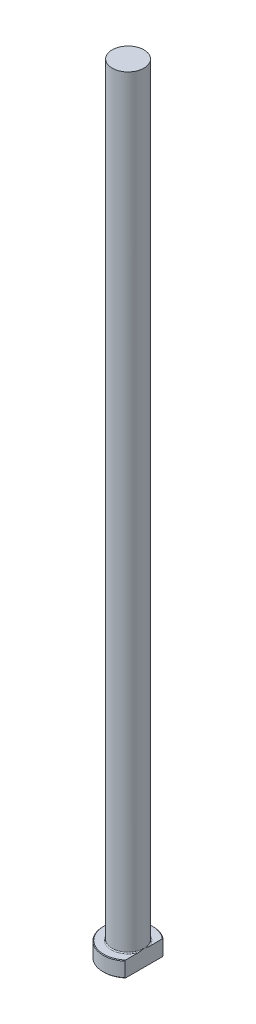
ISO-10303-21;
HEADER;
FILE_DESCRIPTION(('STEP AP214'),'2;1');
FILE_NAME('part.step','',(''),(''),'','','');
FILE_SCHEMA(('AUTOMOTIVE_DESIGN { 1 0 10303 214 1 1 1 1 }'));
ENDSEC;
DATA;
#1=APPLICATION_CONTEXT('core data for automotive mechanical design processes');
#2=APPLICATION_PROTOCOL_DEFINITION('international standard','automotive_design',2000,#1);
#3=PRODUCT_CONTEXT('',#1,'mechanical');
#4=PRODUCT('Part','Part','',(#3));
#5=PRODUCT_RELATED_PRODUCT_CATEGORY('part','',(#4));
#6=PRODUCT_DEFINITION_FORMATION('','',#4);
#7=PRODUCT_DEFINITION_CONTEXT('part definition',#1,'design');
#8=PRODUCT_DEFINITION('design','',#6,#7);
#9=PRODUCT_DEFINITION_SHAPE('','',#8);
#10=(LENGTH_UNIT() NAMED_UNIT(*) SI_UNIT(.MILLI.,.METRE.));
#11=(NAMED_UNIT(*) PLANE_ANGLE_UNIT() SI_UNIT($,.RADIAN.));
#12=(NAMED_UNIT(*) SI_UNIT($,.STERADIAN.) SOLID_ANGLE_UNIT());
#13=UNCERTAINTY_MEASURE_WITH_UNIT(LENGTH_MEASURE(1.E-05),#10,'distance_accuracy_value','');
#14=(GEOMETRIC_REPRESENTATION_CONTEXT(3) GLOBAL_UNCERTAINTY_ASSIGNED_CONTEXT((#13)) GLOBAL_UNIT_ASSIGNED_CONTEXT((#10,
#11,#12)) REPRESENTATION_CONTEXT('',''));
#15=CARTESIAN_POINT('',(0.,0.,0.));
#16=DIRECTION('',(0.,0.,1.));
#17=DIRECTION('',(1.,0.,0.));
#18=AXIS2_PLACEMENT_3D('',#15,#16,#17);
#19=CARTESIAN_POINT('',(0.,0.,0.));
#20=DIRECTION('',(0.,-1.,0.));
#21=DIRECTION('',(0.,0.,-1.));
#22=AXIS2_PLACEMENT_3D('',#19,#20,#21);
#23=PLANE('',#22);
#24=CARTESIAN_POINT('',(0.,0.,0.));
#25=DIRECTION('',(0.,-1.,0.));
#26=DIRECTION('',(0.,0.,-1.));
#27=AXIS2_PLACEMENT_3D('',#24,#25,#26);
#28=CIRCLE('',#27,7.79999999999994);
#29=CARTESIAN_POINT('',(5.09999999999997,0.,5.90169467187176));
#30=VERTEX_POINT('',#29);
#31=CARTESIAN_POINT('',(5.09999999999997,0.,-5.90169467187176));
#32=VERTEX_POINT('',#31);
#33=EDGE_CURVE('E98',#30,#32,#28,.T.);
#34=ORIENTED_EDGE('',*,*,#33,.T.);
#35=DIRECTION('',(0.,0.,1.));
#36=VECTOR('',#35,1.);
#37=CARTESIAN_POINT('',(5.09999999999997,0.,-6.16360284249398));
#38=LINE('',#37,#36);
#39=EDGE_CURVE('E83',#32,#30,#38,.T.);
#40=ORIENTED_EDGE('',*,*,#39,.T.);
#41=EDGE_LOOP('',(#34,#40));
#42=FACE_BOUND('',#41,.T.);
#43=ADVANCED_FACE('F32',(#42),#23,.T.);
#44=CARTESIAN_POINT('',(0.,259.958771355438,0.));
#45=DIRECTION('',(0.,1.,0.));
#46=DIRECTION('',(0.,0.,1.));
#47=AXIS2_PLACEMENT_3D('',#44,#45,#46);
#48=CYLINDRICAL_SURFACE('',#47,7.99999999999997);
#49=CARTESIAN_POINT('',(0.,4.80000000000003,0.));
#50=DIRECTION('',(0.,1.,0.));
#51=DIRECTION('',(0.,0.,1.));
#52=AXIS2_PLACEMENT_3D('',#49,#50,#51);
#53=CIRCLE('',#52,7.99999999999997);
#54=CARTESIAN_POINT('',(5.09999999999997,4.80000000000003,6.16360284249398));
#55=VERTEX_POINT('',#54);
#56=CARTESIAN_POINT('',(5.09999999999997,4.80000000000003,-6.16360284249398));
#57=VERTEX_POINT('',#56);
#58=EDGE_CURVE('E104',#55,#57,#53,.F.);
#59=ORIENTED_EDGE('',*,*,#58,.T.);
#60=DIRECTION('',(0.,-1.,0.));
#61=VECTOR('',#60,1.);
#62=CARTESIAN_POINT('',(5.09999999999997,250.,-6.16360284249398));
#63=LINE('',#62,#61);
#64=CARTESIAN_POINT('',(5.09999999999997,0.200000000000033,-6.16360284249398));
#65=VERTEX_POINT('',#64);
#66=EDGE_CURVE('E183',#57,#65,#63,.T.);
#67=ORIENTED_EDGE('',*,*,#66,.T.);
#68=CARTESIAN_POINT('',(0.,0.200000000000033,0.));
#69=DIRECTION('',(0.,-1.,0.));
#70=DIRECTION('',(0.,0.,-1.));
#71=AXIS2_PLACEMENT_3D('',#68,#69,#70);
#72=CIRCLE('',#71,7.99999999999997);
#73=CARTESIAN_POINT('',(5.09999999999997,0.200000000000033,6.16360284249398));
#74=VERTEX_POINT('',#73);
#75=EDGE_CURVE('E100',#65,#74,#72,.F.);
#76=ORIENTED_EDGE('',*,*,#75,.T.);
#77=DIRECTION('',(0.,-1.,0.));
#78=VECTOR('',#77,1.);
#79=CARTESIAN_POINT('',(5.09999999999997,250.,6.16360284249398));
#80=LINE('',#79,#78);
#81=EDGE_CURVE('E93',#55,#74,#80,.T.);
#82=ORIENTED_EDGE('',*,*,#81,.F.);
#83=EDGE_LOOP('',(#59,#67,#76,#82));
#84=FACE_BOUND('',#83,.T.);
#85=ADVANCED_FACE('F158',(#84),#48,.T.);
#86=CARTESIAN_POINT('',(-7.99999999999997,5.,0.));
#87=DIRECTION('',(0.,1.,0.));
#88=DIRECTION('',(0.,0.,1.));
#89=AXIS2_PLACEMENT_3D('',#86,#87,#88);
#90=PLANE('',#89);
#91=CARTESIAN_POINT('',(0.,5.,0.));
#92=DIRECTION('',(0.,1.,0.));
#93=DIRECTION('',(0.,0.,1.));
#94=AXIS2_PLACEMENT_3D('',#91,#92,#93);
#95=CIRCLE('',#94,7.79999999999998);
#96=CARTESIAN_POINT('',(5.09999999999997,5.,-5.9016946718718));
#97=VERTEX_POINT('',#96);
#98=CARTESIAN_POINT('',(5.09999999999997,5.,5.9016946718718));
#99=VERTEX_POINT('',#98);
#100=EDGE_CURVE('E178',#97,#99,#95,.T.);
#101=ORIENTED_EDGE('',*,*,#100,.T.);
#102=DIRECTION('',(0.,0.,-1.));
#103=VECTOR('',#102,1.);
#104=CARTESIAN_POINT('',(5.09999999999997,5.,0.));
#105=LINE('',#104,#103);
#106=CARTESIAN_POINT('',(5.09999999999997,4.99999999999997,1.77482393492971));
#107=VERTEX_POINT('',#106);
#108=EDGE_CURVE('E57',#99,#107,#105,.T.);
#109=ORIENTED_EDGE('',*,*,#108,.T.);
#110=CARTESIAN_POINT('',(0.,5.,0.));
#111=DIRECTION('',(0.,1.,0.));
#112=DIRECTION('',(0.,0.,1.));
#113=AXIS2_PLACEMENT_3D('',#110,#111,#112);
#114=CIRCLE('',#113,5.39999999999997);
#115=CARTESIAN_POINT('',(5.09999999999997,4.99999999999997,-1.77482393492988));
#116=VERTEX_POINT('',#115);
#117=EDGE_CURVE('E107',#107,#116,#114,.F.);
#118=ORIENTED_EDGE('',*,*,#117,.T.);
#119=EDGE_CURVE('E136',#116,#97,#105,.T.);
#120=ORIENTED_EDGE('',*,*,#119,.T.);
#121=EDGE_LOOP('',(#101,#109,#118,#120));
#122=FACE_BOUND('',#121,.T.);
#123=ADVANCED_FACE('F147',(#122),#90,.T.);
#124=CARTESIAN_POINT('',(0.,5.,0.));
#125=DIRECTION('',(0.,-1.,0.));
#126=DIRECTION('',(0.,0.,-1.));
#127=AXIS2_PLACEMENT_3D('',#124,#125,#126);
#128=CONICAL_SURFACE('',#127,7.79999999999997,0.785398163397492);
#129=ORIENTED_EDGE('',*,*,#58,.F.);
#130=CARTESIAN_POINT('',(5.09999999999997,-1.68838926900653,13.5610996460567));
#131=CARTESIAN_POINT('',(5.09999999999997,-1.49117445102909,13.3503958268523));
#132=CARTESIAN_POINT('',(5.09999999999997,-1.29425912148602,13.1394117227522));
#133=CARTESIAN_POINT('',(5.09999999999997,-0.901124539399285,12.7167935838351));
#134=CARTESIAN_POINT('',(5.09999999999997,-0.704905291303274,12.5051595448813));
#135=CARTESIAN_POINT('',(5.09999999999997,-0.117342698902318,11.8690459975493));
#136=CARTESIAN_POINT('',(5.09999999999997,0.272806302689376,11.4434608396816));
#137=CARTESIAN_POINT('',(5.09999999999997,1.05193640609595,10.5848872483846));
#138=CARTESIAN_POINT('',(5.09999999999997,1.44088225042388,10.1518667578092));
#139=CARTESIAN_POINT('',(5.09999999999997,2.21252525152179,9.28039822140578));
#140=CARTESIAN_POINT('',(5.09999999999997,2.59522339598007,8.84195105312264));
#141=CARTESIAN_POINT('',(5.09999999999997,3.2834654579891,8.03678680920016));
#142=CARTESIAN_POINT('',(5.09999999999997,3.59050446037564,7.67135442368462));
#143=CARTESIAN_POINT('',(5.09999999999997,4.04444149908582,7.1176457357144));
#144=CARTESIAN_POINT('',(5.09999999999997,4.19468098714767,6.93211011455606));
#145=CARTESIAN_POINT('',(5.09999999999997,4.49242146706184,6.55885365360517));
#146=CARTESIAN_POINT('',(5.09999999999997,4.63992249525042,6.37113284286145));
#147=CARTESIAN_POINT('',(5.09999999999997,4.93124846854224,5.99346825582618));
#148=CARTESIAN_POINT('',(5.09999999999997,5.07508033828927,5.80352983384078));
#149=CARTESIAN_POINT('',(5.09999999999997,5.35853965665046,5.42051054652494));
#150=CARTESIAN_POINT('',(5.09999999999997,5.49816682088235,5.22742946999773));
#151=CARTESIAN_POINT('',(5.09999999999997,5.77196390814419,4.83761664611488));
#152=CARTESIAN_POINT('',(5.09999999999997,5.90613746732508,4.6408874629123));
#153=CARTESIAN_POINT('',(5.09999999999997,6.1675386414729,4.24288639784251));
#154=CARTESIAN_POINT('',(5.09999999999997,6.29476755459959,4.0416153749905));
#155=CARTESIAN_POINT('',(5.09999999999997,6.51869473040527,3.66918005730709));
#156=CARTESIAN_POINT('',(5.09999999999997,6.61684568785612,3.49889306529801));
#157=CARTESIAN_POINT('',(5.09999999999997,6.80528626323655,3.15396122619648));
#158=CARTESIAN_POINT('',(5.09999999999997,6.89557493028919,2.97931585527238));
#159=CARTESIAN_POINT('',(5.09999999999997,7.06604933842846,2.62530631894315));
#160=CARTESIAN_POINT('',(5.09999999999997,7.14624387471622,2.44594642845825));
#161=CARTESIAN_POINT('',(5.09999999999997,7.29389284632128,2.08202755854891));
#162=CARTESIAN_POINT('',(5.09999999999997,7.36135077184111,1.89747001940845));
#163=CARTESIAN_POINT('',(5.09999999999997,7.46787946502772,1.56242413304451));
#164=CARTESIAN_POINT('',(5.09999999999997,7.50993657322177,1.41289089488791));
#165=CARTESIAN_POINT('',(5.09999999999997,7.58244227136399,1.11101527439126));
#166=CARTESIAN_POINT('',(5.09999999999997,7.61289239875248,0.958673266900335));
#167=CARTESIAN_POINT('',(5.09999999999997,7.66066060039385,0.652384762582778));
#168=CARTESIAN_POINT('',(5.09999999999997,7.67801796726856,0.498444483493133));
#169=CARTESIAN_POINT('',(5.09999999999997,7.69880109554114,0.189616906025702));
#170=CARTESIAN_POINT('',(5.09999999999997,7.70222744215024,0.0347296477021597));
#171=CARTESIAN_POINT('',(5.09999999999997,7.69494415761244,-0.274953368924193));
#172=CARTESIAN_POINT('',(5.09999999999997,7.68421202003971,-0.429748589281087));
#173=CARTESIAN_POINT('',(5.09999999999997,7.64918519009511,-0.737784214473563));
#174=CARTESIAN_POINT('',(5.09999999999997,7.62488939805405,-0.891024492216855));
#175=CARTESIAN_POINT('',(5.09999999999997,7.56389278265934,-1.19546940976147));
#176=CARTESIAN_POINT('',(5.09999999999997,7.52715417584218,-1.3466663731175));
#177=CARTESIAN_POINT('',(5.09999999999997,7.44288917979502,-1.64598767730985));
#178=CARTESIAN_POINT('',(5.09999999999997,7.39536249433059,-1.79411193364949));
#179=CARTESIAN_POINT('',(5.09999999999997,7.28286361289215,-2.110452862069));
#180=CARTESIAN_POINT('',(5.09999999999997,7.21631794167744,-2.27810587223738));
#181=CARTESIAN_POINT('',(5.09999999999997,7.07327742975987,-2.60914825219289));
#182=CARTESIAN_POINT('',(5.09999999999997,6.99677812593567,-2.77253566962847));
#183=CARTESIAN_POINT('',(5.09999999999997,6.83568399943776,-3.09559415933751));
#184=CARTESIAN_POINT('',(5.09999999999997,6.75107532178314,-3.25525827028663));
#185=CARTESIAN_POINT('',(5.09999999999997,6.57547395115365,-3.57098467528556));
#186=CARTESIAN_POINT('',(5.09999999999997,6.48448213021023,-3.7270474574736));
#187=CARTESIAN_POINT('',(5.09999999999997,6.29613682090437,-4.03803676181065));
#188=CARTESIAN_POINT('',(5.09999999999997,6.19871627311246,-4.19292248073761));
#189=CARTESIAN_POINT('',(5.09999999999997,5.99959202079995,-4.49991023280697));
#190=CARTESIAN_POINT('',(5.09999999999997,5.89788820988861,-4.6520121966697));
#191=CARTESIAN_POINT('',(5.09999999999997,5.69108681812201,-4.95365388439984));
#192=CARTESIAN_POINT('',(5.09999999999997,5.58599284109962,-5.10319608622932));
#193=CARTESIAN_POINT('',(5.09999999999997,5.37292107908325,-5.40020343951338));
#194=CARTESIAN_POINT('',(5.09999999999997,5.2649433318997,-5.54766861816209));
#195=CARTESIAN_POINT('',(5.09999999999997,5.02178839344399,-5.87409503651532));
#196=CARTESIAN_POINT('',(5.09999999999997,4.8860034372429,-6.05260304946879));
#197=CARTESIAN_POINT('',(5.09999999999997,4.61149829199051,-6.40735082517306));
#198=CARTESIAN_POINT('',(5.09999999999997,4.47277800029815,-6.58359050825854));
#199=CARTESIAN_POINT('',(5.09999999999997,4.05300130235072,-7.10948762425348));
#200=CARTESIAN_POINT('',(5.09999999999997,3.76835961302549,-7.45628264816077));
#201=CARTESIAN_POINT('',(5.09999999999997,3.19218529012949,-8.14465597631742));
#202=CARTESIAN_POINT('',(5.09999999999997,2.90064601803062,-8.48622868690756));
#203=CARTESIAN_POINT('',(5.09999999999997,2.31275375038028,-9.16521513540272));
#204=CARTESIAN_POINT('',(5.09999999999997,2.01640062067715,-9.50262875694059));
#205=CARTESIAN_POINT('',(5.09999999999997,1.43877149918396,-10.1532482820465));
#206=CARTESIAN_POINT('',(5.09999999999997,1.15771277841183,-10.4666475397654));
#207=CARTESIAN_POINT('',(5.09999999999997,0.593133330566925,-11.0912313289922));
#208=CARTESIAN_POINT('',(5.09999999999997,0.309612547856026,-11.4024158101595));
#209=CARTESIAN_POINT('',(5.09999999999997,-0.258772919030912,-12.0223487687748));
#210=CARTESIAN_POINT('',(5.09999999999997,-0.54363352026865,-12.3311009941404));
#211=CARTESIAN_POINT('',(5.09999999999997,-1.1149217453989,-12.9471274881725));
#212=CARTESIAN_POINT('',(5.09999999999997,-1.40134929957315,-13.2544018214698));
#213=CARTESIAN_POINT('',(5.09999999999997,-1.68838926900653,-13.5610996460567));
#214=B_SPLINE_CURVE_WITH_KNOTS('',3,(#130,#131,#132,#133,#134,#135,#136,#137,#138,#139,#140,
#141,#142,#143,#144,#145,#146,#147,#148,#149,#150,#151,#152,#153,#154,#155,#156,#157,#158,#159,
#160,#161,#162,#163,#164,#165,#166,#167,#168,#169,#170,#171,#172,#173,#174,#175,#176,#177,#178,
#179,#180,#181,#182,#183,#184,#185,#186,#187,#188,#189,#190,#191,#192,#193,#194,#195,#196,#197,
#198,#199,#200,#201,#202,#203,#204,#205,#206,#207,#208,#209,#210,#211,#212,#213),.UNSPECIFIED.,
.F.,.F.,(4,2,2,2,2,2,2,2,2,2,2,2,2,2,2,2,2,2,2,2,2,2,2,2,2,2,2,2,2,2,2,2,2,2,2,2,2,2,2,2,2,4),
(0.,0.865798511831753,1.73160254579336,3.4636456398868,5.20976443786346,6.95560446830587,
8.38738766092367,9.10357880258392,9.81976043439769,10.5344719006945,11.249231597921,
11.9635066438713,12.677647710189,13.2671324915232,13.8566884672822,14.4457271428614,
15.0346041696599,15.5002159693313,15.9657660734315,16.4299133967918,16.8940412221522,
17.3589077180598,17.8238119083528,18.2901406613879,18.7564822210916,19.2972067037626,
19.838174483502,20.3800835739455,20.921918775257,21.470762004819,22.01961887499,
22.5679103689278,23.116194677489,23.789002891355,24.4618346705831,25.807650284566,
27.1548185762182,28.5020244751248,29.7649097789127,31.0278236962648,32.2880803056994,
33.5482812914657),.UNSPECIFIED.);
#215=EDGE_CURVE('E135',#55,#99,#214,.T.);
#216=ORIENTED_EDGE('',*,*,#215,.T.);
#217=ORIENTED_EDGE('',*,*,#100,.F.);
#218=EDGE_CURVE('E127',#97,#57,#214,.T.);
#219=ORIENTED_EDGE('',*,*,#218,.T.);
#220=EDGE_LOOP('',(#129,#216,#217,#219));
#221=FACE_BOUND('',#220,.T.);
#222=ADVANCED_FACE('F143',(#221),#128,.T.);
#223=CARTESIAN_POINT('',(0.,0.200000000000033,0.));
#224=DIRECTION('',(0.,1.,0.));
#225=DIRECTION('',(0.,0.,1.));
#226=AXIS2_PLACEMENT_3D('',#223,#224,#225);
#227=CONICAL_SURFACE('',#226,7.99999999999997,0.785398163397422);
#228=ORIENTED_EDGE('',*,*,#75,.F.);
#229=CARTESIAN_POINT('',(5.09999999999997,6.68838926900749,-13.5610996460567));
#230=CARTESIAN_POINT('',(5.09999999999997,6.49117445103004,-13.3503958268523));
#231=CARTESIAN_POINT('',(5.09999999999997,6.29425912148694,-13.1394117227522));
#232=CARTESIAN_POINT('',(5.09999999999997,5.90112453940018,-12.7167935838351));
#233=CARTESIAN_POINT('',(5.09999999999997,5.70490529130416,-12.5051595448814));
#234=CARTESIAN_POINT('',(5.09999999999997,5.11734269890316,-11.8690459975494));
#235=CARTESIAN_POINT('',(5.09999999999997,4.72719369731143,-11.4434608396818));
#236=CARTESIAN_POINT('',(5.09999999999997,3.9480635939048,-10.5848872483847));
#237=CARTESIAN_POINT('',(5.09999999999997,3.55911774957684,-10.1518667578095));
#238=CARTESIAN_POINT('',(5.09999999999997,2.78747474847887,-9.28039822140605));
#239=CARTESIAN_POINT('',(5.09999999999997,2.40477660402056,-8.84195105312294));
#240=CARTESIAN_POINT('',(5.09999999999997,1.71653454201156,-8.03678680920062));
#241=CARTESIAN_POINT('',(5.09999999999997,1.40949553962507,-7.6713544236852));
#242=CARTESIAN_POINT('',(5.09999999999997,0.955558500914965,-7.11764573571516));
#243=CARTESIAN_POINT('',(5.09999999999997,0.80531901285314,-6.93211011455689));
#244=CARTESIAN_POINT('',(5.09999999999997,0.507578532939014,-6.55885365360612));
#245=CARTESIAN_POINT('',(5.09999999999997,0.360077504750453,-6.37113284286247));
#246=CARTESIAN_POINT('',(5.09999999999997,0.0687515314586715,-5.99346825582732));
#247=CARTESIAN_POINT('',(5.09999999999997,-0.0750803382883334,-5.80352983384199));
#248=CARTESIAN_POINT('',(5.09999999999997,-0.358539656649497,-5.42051054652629));
#249=CARTESIAN_POINT('',(5.09999999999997,-0.498166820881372,-5.22742946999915));
#250=CARTESIAN_POINT('',(5.09999999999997,-0.771963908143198,-4.83761664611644));
#251=CARTESIAN_POINT('',(5.09999999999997,-0.906137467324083,-4.64088746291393));
#252=CARTESIAN_POINT('',(5.09999999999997,-1.1675386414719,-4.24288639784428));
#253=CARTESIAN_POINT('',(5.09999999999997,-1.29476755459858,-4.04161537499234));
#254=CARTESIAN_POINT('',(5.09999999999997,-1.51869473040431,-3.66918005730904));
#255=CARTESIAN_POINT('',(5.09999999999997,-1.61684568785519,-3.49889306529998));
#256=CARTESIAN_POINT('',(5.09999999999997,-1.80528626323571,-3.15396122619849));
#257=CARTESIAN_POINT('',(5.09999999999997,-1.89557493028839,-2.97931585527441));
#258=CARTESIAN_POINT('',(5.09999999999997,-2.06604933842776,-2.62530631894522));
#259=CARTESIAN_POINT('',(5.09999999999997,-2.14624387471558,-2.44594642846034));
#260=CARTESIAN_POINT('',(5.09999999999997,-2.29389284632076,-2.08202755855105));
#261=CARTESIAN_POINT('',(5.09999999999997,-2.36135077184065,-1.8974700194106));
#262=CARTESIAN_POINT('',(5.09999999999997,-2.46787946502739,-1.56242413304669));
#263=CARTESIAN_POINT('',(5.09999999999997,-2.5099365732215,-1.4128908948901));
#264=CARTESIAN_POINT('',(5.09999999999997,-2.58244227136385,-1.11101527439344));
#265=CARTESIAN_POINT('',(5.09999999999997,-2.61289239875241,-0.958673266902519));
#266=CARTESIAN_POINT('',(5.09999999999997,-2.66066060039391,-0.652384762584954));
#267=CARTESIAN_POINT('',(5.09999999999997,-2.67801796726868,-0.498444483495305));
#268=CARTESIAN_POINT('',(5.09999999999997,-2.6988010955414,-0.189616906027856));
#269=CARTESIAN_POINT('',(5.09999999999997,-2.70222744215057,-0.0347296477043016));
#270=CARTESIAN_POINT('',(5.09999999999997,-2.6949441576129,0.274953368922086));
#271=CARTESIAN_POINT('',(5.09999999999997,-2.68421202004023,0.429748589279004));
#272=CARTESIAN_POINT('',(5.09999999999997,-2.64918519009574,0.73778421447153));
#273=CARTESIAN_POINT('',(5.09999999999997,-2.62488939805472,0.891024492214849));
#274=CARTESIAN_POINT('',(5.09999999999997,-2.56389278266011,1.19546940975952));
#275=CARTESIAN_POINT('',(5.09999999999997,-2.52715417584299,1.34666637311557));
#276=CARTESIAN_POINT('',(5.09999999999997,-2.4428891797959,1.64598767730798));
#277=CARTESIAN_POINT('',(5.09999999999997,-2.3953624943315,1.79411193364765));
#278=CARTESIAN_POINT('',(5.09999999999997,-2.2828636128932,2.11045286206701));
#279=CARTESIAN_POINT('',(5.09999999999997,-2.2163179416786,2.2781058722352));
#280=CARTESIAN_POINT('',(5.09999999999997,-2.07327742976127,2.60914825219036));
#281=CARTESIAN_POINT('',(5.09999999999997,-1.99677812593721,2.77253566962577));
#282=CARTESIAN_POINT('',(5.09999999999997,-1.83568399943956,3.09559415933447));
#283=CARTESIAN_POINT('',(5.09999999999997,-1.75107532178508,3.25525827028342));
#284=CARTESIAN_POINT('',(5.09999999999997,-1.57547395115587,3.57098467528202));
#285=CARTESIAN_POINT('',(5.09999999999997,-1.48448213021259,3.7270474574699));
#286=CARTESIAN_POINT('',(5.09999999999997,-1.29613682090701,4.03803676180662));
#287=CARTESIAN_POINT('',(5.09999999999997,-1.19871627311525,4.19292248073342));
#288=CARTESIAN_POINT('',(5.09999999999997,-0.999592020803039,4.49991023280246));
#289=CARTESIAN_POINT('',(5.09999999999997,-0.897888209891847,4.65201219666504));
#290=CARTESIAN_POINT('',(5.09999999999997,-0.691086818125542,4.95365388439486));
#291=CARTESIAN_POINT('',(5.09999999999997,-0.585992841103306,5.10319608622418));
#292=CARTESIAN_POINT('',(5.09999999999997,-0.372921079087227,5.40020343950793));
#293=CARTESIAN_POINT('',(5.09999999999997,-0.264943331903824,5.54766861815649));
#294=CARTESIAN_POINT('',(5.09999999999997,-0.0217883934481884,5.87409503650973));
#295=CARTESIAN_POINT('',(5.09999999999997,0.113996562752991,6.05260304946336));
#296=CARTESIAN_POINT('',(5.09999999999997,0.388501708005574,6.40735082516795));
#297=CARTESIAN_POINT('',(5.09999999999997,0.52722199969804,6.58359050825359));
#298=CARTESIAN_POINT('',(5.09999999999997,0.946998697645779,7.10948762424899));
#299=CARTESIAN_POINT('',(5.09999999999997,1.23164038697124,7.45628264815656));
#300=CARTESIAN_POINT('',(5.09999999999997,1.80781470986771,8.14465597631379));
#301=CARTESIAN_POINT('',(5.09999999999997,2.09935398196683,8.48622868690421));
#302=CARTESIAN_POINT('',(5.09999999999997,2.68724624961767,9.16521513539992));
#303=CARTESIAN_POINT('',(5.09999999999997,2.98359937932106,9.50262875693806));
#304=CARTESIAN_POINT('',(5.09999999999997,3.56122850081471,10.1532482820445));
#305=CARTESIAN_POINT('',(5.09999999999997,3.84228722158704,10.4666475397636));
#306=CARTESIAN_POINT('',(5.09999999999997,4.40686666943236,11.0912313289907));
#307=CARTESIAN_POINT('',(5.09999999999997,4.69038745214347,11.4024158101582));
#308=CARTESIAN_POINT('',(5.09999999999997,5.25877291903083,12.0223487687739));
#309=CARTESIAN_POINT('',(5.09999999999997,5.54363352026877,12.3311009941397));
#310=CARTESIAN_POINT('',(5.09999999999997,6.11492174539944,12.9471274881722));
#311=CARTESIAN_POINT('',(5.09999999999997,6.4013492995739,13.2544018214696));
#312=CARTESIAN_POINT('',(5.09999999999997,6.68838926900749,13.5610996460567));
#313=B_SPLINE_CURVE_WITH_KNOTS('',3,(#229,#230,#231,#232,#233,#234,#235,#236,#237,#238,#239,
#240,#241,#242,#243,#244,#245,#246,#247,#248,#249,#250,#251,#252,#253,#254,#255,#256,#257,#258,
#259,#260,#261,#262,#263,#264,#265,#266,#267,#268,#269,#270,#271,#272,#273,#274,#275,#276,#277,
#278,#279,#280,#281,#282,#283,#284,#285,#286,#287,#288,#289,#290,#291,#292,#293,#294,#295,#296,
#297,#298,#299,#300,#301,#302,#303,#304,#305,#306,#307,#308,#309,#310,#311,#312),.UNSPECIFIED.,
.F.,.F.,(4,2,2,2,2,2,2,2,2,2,2,2,2,2,2,2,2,2,2,2,2,2,2,2,2,2,2,2,2,2,2,2,2,2,2,2,2,2,2,2,2,4),
(0.,0.865798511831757,1.73160254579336,3.46364563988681,5.20976443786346,6.95560446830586,
8.38738766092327,9.10357880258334,9.81976043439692,10.5344719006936,11.2492315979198,
11.96350664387,12.6776477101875,13.2671324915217,13.8566884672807,14.4457271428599,
15.0346041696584,15.5002159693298,15.9657660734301,16.4299133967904,16.8940412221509,
17.3589077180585,17.8238119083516,18.2901406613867,18.7564822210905,19.2972067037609,
19.8381744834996,20.3800835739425,20.9219187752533,21.4707620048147,22.019618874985,
22.5679103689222,23.1161946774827,23.7890028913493,24.461834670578,25.807650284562,
27.1548185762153,28.502024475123,29.7649097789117,31.0278236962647,32.2880803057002,
33.5482812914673),.UNSPECIFIED.);
#314=EDGE_CURVE('E86',#65,#32,#313,.T.);
#315=ORIENTED_EDGE('',*,*,#314,.T.);
#316=ORIENTED_EDGE('',*,*,#33,.F.);
#317=EDGE_CURVE('E89',#30,#74,#313,.T.);
#318=ORIENTED_EDGE('',*,*,#317,.T.);
#319=EDGE_LOOP('',(#228,#315,#316,#318));
#320=FACE_BOUND('',#319,.T.);
#321=ADVANCED_FACE('F97',(#320),#227,.T.);
#322=CARTESIAN_POINT('',(0.,5.29999999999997,0.));
#323=DIRECTION('',(0.,1.,0.));
#324=DIRECTION('',(0.,0.,1.));
#325=AXIS2_PLACEMENT_3D('',#322,#323,#324);
#326=TOROIDAL_SURFACE('',#325,5.39999999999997,0.3);
#327=CARTESIAN_POINT('',(5.09999999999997,5.29999999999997,0.));
#328=CARTESIAN_POINT('',(5.09999999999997,5.30000062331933,1.00502455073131E-10));
#329=CARTESIAN_POINT('',(5.09999999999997,5.30000124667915,-2.56272245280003E-07));
#330=CARTESIAN_POINT('',(5.09999999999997,5.30000240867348,-9.58155656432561E-07));
#331=CARTESIAN_POINT('',(5.09999999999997,5.30000293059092,-1.42128215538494E-06));
#332=CARTESIAN_POINT('',(5.09999999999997,5.30000402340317,-2.53262703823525E-06));
#333=CARTESIAN_POINT('',(5.09999999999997,5.30000457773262,-3.19888437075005E-06));
#334=CARTESIAN_POINT('',(5.09999999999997,5.3000055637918,-4.57422758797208E-06));
#335=CARTESIAN_POINT('',(5.09999999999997,5.3000059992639,-5.28085592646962E-06));
#336=CARTESIAN_POINT('',(5.09999999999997,5.3000076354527,-8.04031793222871E-06));
#337=CARTESIAN_POINT('',(5.09999999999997,5.30000874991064,-1.01478584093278E-05));
#338=CARTESIAN_POINT('',(5.09999999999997,5.30001056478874,-1.43037796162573E-05));
#339=CARTESIAN_POINT('',(5.09999999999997,5.30001129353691,-1.63402753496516E-05));
#340=CARTESIAN_POINT('',(5.09999999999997,5.30001438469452,-2.50239477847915E-05));
#341=CARTESIAN_POINT('',(5.09999999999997,5.30001671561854,-3.16857680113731E-05));
#342=CARTESIAN_POINT('',(5.09999999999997,5.30002011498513,-4.42245824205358E-05));
#343=CARTESIAN_POINT('',(5.09999999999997,5.30002132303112,-5.00633656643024E-05));
#344=CARTESIAN_POINT('',(5.09999999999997,5.30003017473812,-9.36444945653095E-05));
#345=CARTESIAN_POINT('',(5.09999999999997,5.30003694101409,-0.000131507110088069));
#346=CARTESIAN_POINT('',(5.09999999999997,5.30006656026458,-0.000281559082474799));
#347=CARTESIAN_POINT('',(5.09999999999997,5.30009476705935,-0.000392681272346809));
#348=CARTESIAN_POINT('',(5.09999999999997,5.30020497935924,-0.000834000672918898));
#349=CARTESIAN_POINT('',(5.09999999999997,5.30028356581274,-0.00116477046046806));
#350=CARTESIAN_POINT('',(5.09999999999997,5.3005991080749,-0.0024833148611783));
#351=CARTESIAN_POINT('',(5.09999999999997,5.30084040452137,-0.00347033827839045));
#352=CARTESIAN_POINT('',(5.09999999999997,5.30184681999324,-0.00759777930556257));
#353=CARTESIAN_POINT('',(5.09999999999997,5.30260646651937,-0.0107391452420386));
#354=CARTESIAN_POINT('',(5.09999999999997,5.30990583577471,-0.0409103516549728));
#355=CARTESIAN_POINT('',(5.09999999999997,5.31647007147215,-0.0679360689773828));
#356=CARTESIAN_POINT('',(5.09999999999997,5.32929459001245,-0.120902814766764));
#357=CARTESIAN_POINT('',(5.09999999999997,5.33555642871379,-0.146843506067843));
#358=CARTESIAN_POINT('',(5.09999999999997,5.34884216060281,-0.202060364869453));
#359=CARTESIAN_POINT('',(5.09999999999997,5.35586083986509,-0.231337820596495));
#360=CARTESIAN_POINT('',(5.09999999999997,5.36989412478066,-0.290236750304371));
#361=CARTESIAN_POINT('',(5.09999999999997,5.37690782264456,-0.319858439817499));
#362=CARTESIAN_POINT('',(5.09999999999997,5.39370531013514,-0.391396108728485));
#363=CARTESIAN_POINT('',(5.09999999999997,5.40343385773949,-0.433325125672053));
#364=CARTESIAN_POINT('',(5.09999999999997,5.42233571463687,-0.51616106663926));
#365=CARTESIAN_POINT('',(5.09999999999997,5.43151688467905,-0.55706619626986));
#366=CARTESIAN_POINT('',(5.09999999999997,5.45452080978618,-0.661777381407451));
#367=CARTESIAN_POINT('',(5.09999999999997,5.46807892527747,-0.725642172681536));
#368=CARTESIAN_POINT('',(5.09999999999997,5.4940673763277,-0.854162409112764));
#369=CARTESIAN_POINT('',(5.09999999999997,5.5064872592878,-0.918819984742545));
#370=CARTESIAN_POINT('',(5.09999999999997,5.53078685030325,-1.05464624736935));
#371=CARTESIAN_POINT('',(5.09999999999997,5.5425007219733,-1.12584508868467));
#372=CARTESIAN_POINT('',(5.09999999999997,5.56331904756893,-1.2686184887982));
#373=CARTESIAN_POINT('',(5.09999999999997,5.57242395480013,-1.34019298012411));
#374=CARTESIAN_POINT('',(5.09999999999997,5.58708832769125,-1.48237032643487));
#375=CARTESIAN_POINT('',(5.09999999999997,5.59271078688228,-1.55296638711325));
#376=CARTESIAN_POINT('',(5.09999999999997,5.59964105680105,-1.69455989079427));
#377=CARTESIAN_POINT('',(5.09999999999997,5.60093824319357,-1.7655578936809));
#378=CARTESIAN_POINT('',(5.09999999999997,5.59769411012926,-1.90544222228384));
#379=CARTESIAN_POINT('',(5.09999999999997,5.59332114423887,-1.97433003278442));
#380=CARTESIAN_POINT('',(5.09999999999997,5.58075096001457,-2.07681569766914));
#381=CARTESIAN_POINT('',(5.09999999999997,5.57557260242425,-2.11078113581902));
#382=CARTESIAN_POINT('',(5.09999999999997,5.56270516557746,-2.17822373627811));
#383=CARTESIAN_POINT('',(5.09999999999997,5.55501865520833,-2.21170136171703));
#384=CARTESIAN_POINT('',(5.09999999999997,5.54146504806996,-2.25971093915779));
#385=CARTESIAN_POINT('',(5.09999999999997,5.53689562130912,-2.27460808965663));
#386=CARTESIAN_POINT('',(5.09999999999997,5.52697250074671,-2.30414012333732));
#387=CARTESIAN_POINT('',(5.09999999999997,5.52161846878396,-2.31877489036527));
#388=CARTESIAN_POINT('',(5.09999999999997,5.50422688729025,-2.36209889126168));
#389=CARTESIAN_POINT('',(5.09999999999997,5.49083502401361,-2.3903019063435));
#390=CARTESIAN_POINT('',(5.09999999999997,5.46786086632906,-2.42877296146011));
#391=CARTESIAN_POINT('',(5.09999999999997,5.4603260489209,-2.44026309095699));
#392=CARTESIAN_POINT('',(5.09999999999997,5.44403681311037,-2.46240090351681));
#393=CARTESIAN_POINT('',(5.09999999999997,5.43527992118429,-2.47304680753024));
#394=CARTESIAN_POINT('',(5.09999999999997,5.41620529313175,-2.49317992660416));
#395=CARTESIAN_POINT('',(5.09999999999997,5.40586565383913,-2.50264683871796));
#396=CARTESIAN_POINT('',(5.09999999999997,5.3835690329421,-2.5194267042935));
#397=CARTESIAN_POINT('',(5.09999999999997,5.37162091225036,-2.5267508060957));
#398=CARTESIAN_POINT('',(5.09999999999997,5.35166538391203,-2.53574339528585));
#399=CARTESIAN_POINT('',(5.09999999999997,5.34414545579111,-2.53849221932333));
#400=CARTESIAN_POINT('',(5.09999999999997,5.32875362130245,-2.54271562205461));
#401=CARTESIAN_POINT('',(5.09999999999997,5.32088204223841,-2.5441913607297));
#402=CARTESIAN_POINT('',(5.09999999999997,5.30496570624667,-2.54573009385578));
#403=CARTESIAN_POINT('',(5.09999999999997,5.29692036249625,-2.54578715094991));
#404=CARTESIAN_POINT('',(5.09999999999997,5.28094771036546,-2.54446730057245));
#405=CARTESIAN_POINT('',(5.09999999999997,5.27302044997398,-2.54308982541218));
#406=CARTESIAN_POINT('',(5.09999999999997,5.25787452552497,-2.53913219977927));
#407=CARTESIAN_POINT('',(5.09999999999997,5.25064005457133,-2.53661104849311));
#408=CARTESIAN_POINT('',(5.09999999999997,5.23660403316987,-2.53057544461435));
#409=CARTESIAN_POINT('',(5.09999999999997,5.22980263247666,-2.52706065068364));
#410=CARTESIAN_POINT('',(5.09999999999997,5.21241680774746,-2.51668428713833));
#411=CARTESIAN_POINT('',(5.09999999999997,5.20224553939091,-2.50913195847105));
#412=CARTESIAN_POINT('',(5.09999999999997,5.18317971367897,-2.49255314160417));
#413=CARTESIAN_POINT('',(5.09999999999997,5.17428964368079,-2.48352169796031));
#414=CARTESIAN_POINT('',(5.09999999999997,5.15120222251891,-2.45711400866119));
#415=CARTESIAN_POINT('',(5.09999999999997,5.13821905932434,-2.43868687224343));
#416=CARTESIAN_POINT('',(5.09999999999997,5.11496748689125,-2.40025423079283));
#417=CARTESIAN_POINT('',(5.09999999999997,5.10470258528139,-2.38024672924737));
#418=CARTESIAN_POINT('',(5.09999999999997,5.08559509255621,-2.33784185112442));
#419=CARTESIAN_POINT('',(5.09999999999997,5.07690690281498,-2.31537591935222));
#420=CARTESIAN_POINT('',(5.09999999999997,5.06139749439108,-2.26979738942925));
#421=CARTESIAN_POINT('',(5.09999999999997,5.05457848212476,-2.24668406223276));
#422=CARTESIAN_POINT('',(5.09999999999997,5.04239975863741,-2.1998307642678));
#423=CARTESIAN_POINT('',(5.09999999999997,5.03705561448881,-2.17608680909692));
#424=CARTESIAN_POINT('',(5.09999999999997,5.02766167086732,-2.12836719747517));
#425=CARTESIAN_POINT('',(5.09999999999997,5.02361095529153,-2.10439171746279));
#426=CARTESIAN_POINT('',(5.09999999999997,5.01439130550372,-2.04113234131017));
#427=CARTESIAN_POINT('',(5.09999999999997,5.01012481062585,-2.00171697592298));
#428=CARTESIAN_POINT('',(5.09999999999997,5.00388663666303,-1.92269917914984));
#429=CARTESIAN_POINT('',(5.09999999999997,5.00191621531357,-1.88309665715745));
#430=CARTESIAN_POINT('',(5.09999999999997,4.99879803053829,-1.76395655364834));
#431=CARTESIAN_POINT('',(5.09999999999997,5.00047462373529,-1.68434528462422));
#432=CARTESIAN_POINT('',(5.09999999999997,5.00888754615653,-1.52975473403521));
#433=CARTESIAN_POINT('',(5.09999999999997,5.01534627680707,-1.45475708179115));
#434=CARTESIAN_POINT('',(5.09999999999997,5.0317664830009,-1.30572790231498));
#435=CARTESIAN_POINT('',(5.09999999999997,5.04170115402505,-1.23169335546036));
#436=CARTESIAN_POINT('',(5.09999999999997,5.06541265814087,-1.07626149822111));
#437=CARTESIAN_POINT('',(5.09999999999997,5.07948398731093,-0.99491013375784));
#438=CARTESIAN_POINT('',(5.09999999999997,5.10254680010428,-0.872231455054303));
#439=CARTESIAN_POINT('',(5.09999999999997,5.11066831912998,-0.830736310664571));
#440=CARTESIAN_POINT('',(5.09999999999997,5.12745388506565,-0.747740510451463));
#441=CARTESIAN_POINT('',(5.09999999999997,5.13611932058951,-0.706240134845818));
#442=CARTESIAN_POINT('',(5.09999999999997,5.15735306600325,-0.607104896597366));
#443=CARTESIAN_POINT('',(5.09999999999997,5.17012138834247,-0.549513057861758));
#444=CARTESIAN_POINT('',(5.09999999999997,5.19610836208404,-0.435113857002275));
#445=CARTESIAN_POINT('',(5.09999999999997,5.20932032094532,-0.378304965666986));
#446=CARTESIAN_POINT('',(5.09999999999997,5.23456914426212,-0.271298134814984));
#447=CARTESIAN_POINT('',(5.09999999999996,5.24656654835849,-0.221090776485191));
#448=CARTESIAN_POINT('',(5.09999999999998,5.27126433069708,-0.118550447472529));
#449=CARTESIAN_POINT('',(5.10000000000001,5.28397269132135,-0.0662193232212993));
#450=CARTESIAN_POINT('',(5.09999999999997,5.29739466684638,-0.0107340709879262));
#451=CARTESIAN_POINT('',(5.09999999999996,5.29815561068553,-0.00758765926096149));
#452=CARTESIAN_POINT('',(5.09999999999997,5.29916232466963,-0.00345908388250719));
#453=CARTESIAN_POINT('',(5.09999999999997,5.29940265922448,-0.00247597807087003));
#454=CARTESIAN_POINT('',(5.09999999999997,5.29971703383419,-0.00116231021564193));
#455=CARTESIAN_POINT('',(5.09999999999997,5.29979539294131,-0.000832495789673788));
#456=CARTESIAN_POINT('',(5.09999999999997,5.29990533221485,-0.000392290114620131));
#457=CARTESIAN_POINT('',(5.09999999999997,5.29993350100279,-0.000281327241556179));
#458=CARTESIAN_POINT('',(5.09999999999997,5.29996308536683,-0.000131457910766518));
#459=CARTESIAN_POINT('',(5.09999999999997,5.29996984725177,-9.36171898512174E-05));
#460=CARTESIAN_POINT('',(5.09999999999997,5.29997868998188,-5.00584682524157E-05));
#461=CARTESIAN_POINT('',(5.09999999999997,5.2999798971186,-4.42208592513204E-05));
#462=CARTESIAN_POINT('',(5.09999999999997,5.29998329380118,-3.16844912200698E-05));
#463=CARTESIAN_POINT('',(5.09999999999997,5.29998562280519,-2.50238809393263E-05));
#464=CARTESIAN_POINT('',(5.09999999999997,5.29998871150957,-1.63414750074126E-05));
#465=CARTESIAN_POINT('',(5.09999999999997,5.29998943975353,-1.43050668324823E-05));
#466=CARTESIAN_POINT('',(5.09999999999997,5.29999125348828,-1.01492415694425E-05));
#467=CARTESIAN_POINT('',(5.09999999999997,5.29999236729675,-8.04169787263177E-06));
#468=CARTESIAN_POINT('',(5.09999999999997,5.29999400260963,-5.28214008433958E-06));
#469=CARTESIAN_POINT('',(5.09999999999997,5.2999944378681,-4.57545909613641E-06));
#470=CARTESIAN_POINT('',(5.09999999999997,5.29999542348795,-3.19997201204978E-06));
#471=CARTESIAN_POINT('',(5.09999999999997,5.29999597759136,-2.53362183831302E-06));
#472=CARTESIAN_POINT('',(5.09999999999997,5.2999970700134,-1.42206069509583E-06));
#473=CARTESIAN_POINT('',(5.09999999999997,5.29999759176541,-9.58819427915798E-07));
#474=CARTESIAN_POINT('',(5.09999999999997,5.29999875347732,-2.566431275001E-07));
#475=CARTESIAN_POINT('',(5.09999999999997,5.29999937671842,-1.00496358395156E-10));
#476=CARTESIAN_POINT('',(5.09999999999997,5.29999999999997,0.));
#477=B_SPLINE_CURVE_WITH_KNOTS('',3,(#327,#328,#329,#330,#331,#332,#333,#334,#335,#336,#337,
#338,#339,#340,#341,#342,#343,#344,#345,#346,#347,#348,#349,#350,#351,#352,#353,#354,#355,#356,
#357,#358,#359,#360,#361,#362,#363,#364,#365,#366,#367,#368,#369,#370,#371,#372,#373,#374,#375,
#376,#377,#378,#379,#380,#381,#382,#383,#384,#385,#386,#387,#388,#389,#390,#391,#392,#393,#394,
#395,#396,#397,#398,#399,#400,#401,#402,#403,#404,#405,#406,#407,#408,#409,#410,#411,#412,#413,
#414,#415,#416,#417,#418,#419,#420,#421,#422,#423,#424,#425,#426,#427,#428,#429,#430,#431,#432,
#433,#434,#435,#436,#437,#438,#439,#440,#441,#442,#443,#444,#445,#446,#447,#448,#449,#450,#451,
#452,#453,#454,#455,#456,#457,#458,#459,#460,#461,#462,#463,#464,#465,#466,#467,#468,#469,#470,
#471,#472,#473,#474,#475,#476),.UNSPECIFIED.,.T.,.F.,(4,2,2,2,2,2,2,2,2,2,2,2,2,2,2,2,2,2,2,2,2,
2,2,2,2,2,2,2,2,2,2,2,2,2,2,2,2,2,2,2,2,2,2,2,2,2,2,2,2,2,2,2,2,2,2,2,2,2,2,2,2,2,2,2,2,2,2,2,2,
2,2,2,2,2,4),(0.,1.89160361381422E-06,3.99004216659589E-06,6.57353785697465E-06,
9.06254729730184E-06,1.61899929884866E-05,2.26728988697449E-05,4.38126588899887E-05,
6.1678916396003E-05,0.000177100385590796,0.000520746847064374,0.00154098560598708,
0.00458888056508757,0.0142850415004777,0.0977171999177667,0.177775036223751,0.268095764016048,
0.359417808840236,0.48854538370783,0.614312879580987,0.810167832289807,1.00767122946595,
1.22410237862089,1.44049590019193,1.65285112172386,1.86572757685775,2.07242589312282,
2.17543511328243,2.27833915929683,2.32506388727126,2.37180881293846,2.46500788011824,
2.50617281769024,2.54742231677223,2.58930523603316,2.6309662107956,2.6548934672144,
2.67879889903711,2.70280436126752,2.72681932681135,2.7497158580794,2.7726202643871,
2.8104058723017,2.84832076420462,2.91556471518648,2.98289501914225,3.05504478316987,
3.12727935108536,3.20024948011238,3.27316781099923,3.39200983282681,3.51091692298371,
3.74950974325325,3.97524204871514,4.19927066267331,4.44689882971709,4.5737438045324,
4.70092693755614,4.87789308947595,5.05286589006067,5.20772921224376,5.36928080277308,
5.37899257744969,5.38202837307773,5.38304566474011,5.38338882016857,5.38350417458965,
5.38352203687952,5.38354317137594,5.3835496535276,5.38355678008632,5.38355926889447,
5.38356185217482,5.3835639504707,5.38356584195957),.UNSPECIFIED.);
#478=CARTESIAN_POINT('',(5.09999999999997,5.29999999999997,0.));
#479=VERTEX_POINT('',#478);
#480=EDGE_CURVE('E11',#116,#479,#477,.T.);
#481=ORIENTED_EDGE('',*,*,#480,.F.);
#482=ORIENTED_EDGE('',*,*,#117,.F.);
#483=CARTESIAN_POINT('',(5.09999999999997,5.29999999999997,0.));
#484=CARTESIAN_POINT('',(5.09999999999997,5.29999937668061,-1.00502438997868E-10));
#485=CARTESIAN_POINT('',(5.09999999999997,5.2999987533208,2.56272245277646E-07));
#486=CARTESIAN_POINT('',(5.09999999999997,5.29999759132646,9.58155656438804E-07));
#487=CARTESIAN_POINT('',(5.09999999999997,5.29999706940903,1.42128215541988E-06));
#488=CARTESIAN_POINT('',(5.09999999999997,5.29999597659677,2.53262703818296E-06));
#489=CARTESIAN_POINT('',(5.09999999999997,5.29999542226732,3.19888437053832E-06));
#490=CARTESIAN_POINT('',(5.09999999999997,5.29999443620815,4.57422758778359E-06));
#491=CARTESIAN_POINT('',(5.09999999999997,5.29999400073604,5.28085592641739E-06));
#492=CARTESIAN_POINT('',(5.09999999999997,5.29999236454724,8.0403179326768E-06));
#493=CARTESIAN_POINT('',(5.09999999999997,5.2999912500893,1.01478584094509E-05));
#494=CARTESIAN_POINT('',(5.09999999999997,5.2999894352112,1.43037796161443E-05));
#495=CARTESIAN_POINT('',(5.09999999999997,5.29998870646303,1.6340275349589E-05));
#496=CARTESIAN_POINT('',(5.09999999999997,5.29998561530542,2.50239477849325E-05));
#497=CARTESIAN_POINT('',(5.09999999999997,5.2999832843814,3.16857680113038E-05));
#498=CARTESIAN_POINT('',(5.09999999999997,5.29997988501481,4.42245824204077E-05));
#499=CARTESIAN_POINT('',(5.09999999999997,5.29997867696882,5.00633656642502E-05));
#500=CARTESIAN_POINT('',(5.09999999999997,5.29996982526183,9.36444945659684E-05));
#501=CARTESIAN_POINT('',(5.09999999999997,5.29996305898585,0.000131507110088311));
#502=CARTESIAN_POINT('',(5.09999999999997,5.29993343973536,0.000281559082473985));
#503=CARTESIAN_POINT('',(5.09999999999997,5.29990523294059,0.000392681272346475));
#504=CARTESIAN_POINT('',(5.09999999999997,5.29979502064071,0.000834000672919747));
#505=CARTESIAN_POINT('',(5.09999999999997,5.2997164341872,0.00116477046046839));
#506=CARTESIAN_POINT('',(5.09999999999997,5.29940089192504,0.00248331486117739));
#507=CARTESIAN_POINT('',(5.09999999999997,5.29915959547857,0.00347033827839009));
#508=CARTESIAN_POINT('',(5.09999999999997,5.2981531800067,0.00759777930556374));
#509=CARTESIAN_POINT('',(5.09999999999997,5.29739353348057,0.0107391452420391));
#510=CARTESIAN_POINT('',(5.09999999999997,5.29009416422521,0.0409103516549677));
#511=CARTESIAN_POINT('',(5.09999999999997,5.28352992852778,0.0679360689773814));
#512=CARTESIAN_POINT('',(5.09999999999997,5.2707054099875,0.120902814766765));
#513=CARTESIAN_POINT('',(5.09999999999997,5.26444357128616,0.146843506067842));
#514=CARTESIAN_POINT('',(5.09999999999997,5.25115783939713,0.202060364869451));
#515=CARTESIAN_POINT('',(5.09999999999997,5.24413916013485,0.231337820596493));
#516=CARTESIAN_POINT('',(5.09999999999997,5.23010587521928,0.29023675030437));
#517=CARTESIAN_POINT('',(5.09999999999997,5.22309217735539,0.319858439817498));
#518=CARTESIAN_POINT('',(5.09999999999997,5.20629468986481,0.391396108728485));
#519=CARTESIAN_POINT('',(5.09999999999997,5.19656614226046,0.433325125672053));
#520=CARTESIAN_POINT('',(5.09999999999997,5.17766428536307,0.51616106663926));
#521=CARTESIAN_POINT('',(5.09999999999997,5.16848311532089,0.55706619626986));
#522=CARTESIAN_POINT('',(5.09999999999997,5.14547919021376,0.661777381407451));
#523=CARTESIAN_POINT('',(5.09999999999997,5.13192107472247,0.725642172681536));
#524=CARTESIAN_POINT('',(5.09999999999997,5.10593262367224,0.854162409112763));
#525=CARTESIAN_POINT('',(5.09999999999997,5.09351274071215,0.918819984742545));
#526=CARTESIAN_POINT('',(5.09999999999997,5.06921314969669,1.05464624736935));
#527=CARTESIAN_POINT('',(5.09999999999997,5.05749927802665,1.12584508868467));
#528=CARTESIAN_POINT('',(5.09999999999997,5.03668095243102,1.2686184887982));
#529=CARTESIAN_POINT('',(5.09999999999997,5.02757604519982,1.34019298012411));
#530=CARTESIAN_POINT('',(5.09999999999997,5.0129116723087,1.48237032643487));
#531=CARTESIAN_POINT('',(5.09999999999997,5.00728921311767,1.55296638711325));
#532=CARTESIAN_POINT('',(5.09999999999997,5.00035894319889,1.69455989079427));
#533=CARTESIAN_POINT('',(5.09999999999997,4.99906175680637,1.7655578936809));
#534=CARTESIAN_POINT('',(5.09999999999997,5.00230588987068,1.90544222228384));
#535=CARTESIAN_POINT('',(5.09999999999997,5.00667885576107,1.97433003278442));
#536=CARTESIAN_POINT('',(5.09999999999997,5.01924903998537,2.07681569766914));
#537=CARTESIAN_POINT('',(5.09999999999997,5.02442739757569,2.11078113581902));
#538=CARTESIAN_POINT('',(5.09999999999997,5.03729483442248,2.17822373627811));
#539=CARTESIAN_POINT('',(5.09999999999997,5.04498134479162,2.21170136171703));
#540=CARTESIAN_POINT('',(5.09999999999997,5.05853495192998,2.25971093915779));
#541=CARTESIAN_POINT('',(5.09999999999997,5.06310437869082,2.27460808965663));
#542=CARTESIAN_POINT('',(5.09999999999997,5.07302749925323,2.30414012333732));
#543=CARTESIAN_POINT('',(5.09999999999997,5.07838153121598,2.31877489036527));
#544=CARTESIAN_POINT('',(5.09999999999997,5.09577311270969,2.36209889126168));
#545=CARTESIAN_POINT('',(5.09999999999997,5.10916497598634,2.3903019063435));
#546=CARTESIAN_POINT('',(5.09999999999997,5.13213913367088,2.42877296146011));
#547=CARTESIAN_POINT('',(5.09999999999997,5.13967395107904,2.44026309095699));
#548=CARTESIAN_POINT('',(5.09999999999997,5.15596318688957,2.46240090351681));
#549=CARTESIAN_POINT('',(5.09999999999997,5.16472007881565,2.47304680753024));
#550=CARTESIAN_POINT('',(5.09999999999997,5.18379470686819,2.49317992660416));
#551=CARTESIAN_POINT('',(5.09999999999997,5.19413434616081,2.50264683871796));
#552=CARTESIAN_POINT('',(5.09999999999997,5.21643096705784,2.5194267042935));
#553=CARTESIAN_POINT('',(5.09999999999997,5.22837908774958,2.5267508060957));
#554=CARTESIAN_POINT('',(5.09999999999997,5.24833461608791,2.53574339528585));
#555=CARTESIAN_POINT('',(5.09999999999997,5.25585454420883,2.53849221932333));
#556=CARTESIAN_POINT('',(5.09999999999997,5.2712463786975,2.54271562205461));
#557=CARTESIAN_POINT('',(5.09999999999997,5.27911795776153,2.5441913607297));
#558=CARTESIAN_POINT('',(5.09999999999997,5.29503429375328,2.54573009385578));
#559=CARTESIAN_POINT('',(5.09999999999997,5.3030796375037,2.54578715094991));
#560=CARTESIAN_POINT('',(5.09999999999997,5.31905228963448,2.54446730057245));
#561=CARTESIAN_POINT('',(5.09999999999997,5.32697955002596,2.54308982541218));
#562=CARTESIAN_POINT('',(5.09999999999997,5.34212547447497,2.53913219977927));
#563=CARTESIAN_POINT('',(5.09999999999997,5.34935994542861,2.53661104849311));
#564=CARTESIAN_POINT('',(5.09999999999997,5.36339596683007,2.53057544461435));
#565=CARTESIAN_POINT('',(5.09999999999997,5.37019736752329,2.52706065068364));
#566=CARTESIAN_POINT('',(5.09999999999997,5.38758319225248,2.51668428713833));
#567=CARTESIAN_POINT('',(5.09999999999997,5.39775446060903,2.50913195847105));
#568=CARTESIAN_POINT('',(5.09999999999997,5.41682028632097,2.49255314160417));
#569=CARTESIAN_POINT('',(5.09999999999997,5.42571035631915,2.48352169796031));
#570=CARTESIAN_POINT('',(5.09999999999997,5.44879777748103,2.45711400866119));
#571=CARTESIAN_POINT('',(5.09999999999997,5.4617809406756,2.43868687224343));
#572=CARTESIAN_POINT('',(5.09999999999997,5.48503251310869,2.40025423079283));
#573=CARTESIAN_POINT('',(5.09999999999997,5.49529741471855,2.38024672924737));
#574=CARTESIAN_POINT('',(5.09999999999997,5.51440490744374,2.33784185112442));
#575=CARTESIAN_POINT('',(5.09999999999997,5.52309309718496,2.31537591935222));
#576=CARTESIAN_POINT('',(5.09999999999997,5.53860250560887,2.26979738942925));
#577=CARTESIAN_POINT('',(5.09999999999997,5.54542151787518,2.24668406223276));
#578=CARTESIAN_POINT('',(5.09999999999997,5.55760024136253,2.1998307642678));
#579=CARTESIAN_POINT('',(5.09999999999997,5.56294438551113,2.17608680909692));
#580=CARTESIAN_POINT('',(5.09999999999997,5.57233832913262,2.12836719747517));
#581=CARTESIAN_POINT('',(5.09999999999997,5.57638904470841,2.10439171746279));
#582=CARTESIAN_POINT('',(5.09999999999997,5.58560869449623,2.04113234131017));
#583=CARTESIAN_POINT('',(5.09999999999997,5.5898751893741,2.00171697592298));
#584=CARTESIAN_POINT('',(5.09999999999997,5.59611336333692,1.92269917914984));
#585=CARTESIAN_POINT('',(5.09999999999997,5.59808378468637,1.88309665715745));
#586=CARTESIAN_POINT('',(5.09999999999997,5.60120196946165,1.76395655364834));
#587=CARTESIAN_POINT('',(5.09999999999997,5.59952537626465,1.68434528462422));
#588=CARTESIAN_POINT('',(5.09999999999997,5.59111245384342,1.5297547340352));
#589=CARTESIAN_POINT('',(5.09999999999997,5.58465372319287,1.45475708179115));
#590=CARTESIAN_POINT('',(5.09999999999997,5.56823351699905,1.30572790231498));
#591=CARTESIAN_POINT('',(5.09999999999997,5.55829884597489,1.23169335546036));
#592=CARTESIAN_POINT('',(5.09999999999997,5.53458734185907,1.07626149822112));
#593=CARTESIAN_POINT('',(5.09999999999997,5.52051601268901,0.994910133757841));
#594=CARTESIAN_POINT('',(5.09999999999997,5.49745319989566,0.872231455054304));
#595=CARTESIAN_POINT('',(5.09999999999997,5.48933168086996,0.830736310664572));
#596=CARTESIAN_POINT('',(5.09999999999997,5.47254611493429,0.747740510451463));
#597=CARTESIAN_POINT('',(5.09999999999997,5.46388067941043,0.706240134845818));
#598=CARTESIAN_POINT('',(5.09999999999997,5.44264693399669,0.607104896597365));
#599=CARTESIAN_POINT('',(5.09999999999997,5.42987861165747,0.549513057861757));
#600=CARTESIAN_POINT('',(5.09999999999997,5.4038916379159,0.435113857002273));
#601=CARTESIAN_POINT('',(5.09999999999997,5.39067967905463,0.378304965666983));
#602=CARTESIAN_POINT('',(5.09999999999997,5.36543085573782,0.271298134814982));
#603=CARTESIAN_POINT('',(5.09999999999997,5.35343345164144,0.22109077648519));
#604=CARTESIAN_POINT('',(5.09999999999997,5.32873566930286,0.118550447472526));
#605=CARTESIAN_POINT('',(5.09999999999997,5.31602730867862,0.0662193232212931));
#606=CARTESIAN_POINT('',(5.09999999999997,5.30260533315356,0.0107340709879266));
#607=CARTESIAN_POINT('',(5.09999999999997,5.3018443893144,0.00758765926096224));
#608=CARTESIAN_POINT('',(5.09999999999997,5.30083767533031,0.00345908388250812));
#609=CARTESIAN_POINT('',(5.09999999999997,5.30059734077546,0.00247597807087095));
#610=CARTESIAN_POINT('',(5.09999999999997,5.30028296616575,0.00116231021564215));
#611=CARTESIAN_POINT('',(5.09999999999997,5.30020460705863,0.00083249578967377));
#612=CARTESIAN_POINT('',(5.09999999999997,5.30009466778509,0.000392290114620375));
#613=CARTESIAN_POINT('',(5.09999999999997,5.30006649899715,0.00028132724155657));
#614=CARTESIAN_POINT('',(5.09999999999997,5.30003691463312,0.000131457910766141));
#615=CARTESIAN_POINT('',(5.09999999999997,5.30003015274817,9.36171898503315E-05));
#616=CARTESIAN_POINT('',(5.09999999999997,5.30002131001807,5.00584682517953E-05));
#617=CARTESIAN_POINT('',(5.09999999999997,5.30002010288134,4.42208592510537E-05));
#618=CARTESIAN_POINT('',(5.09999999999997,5.30001670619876,3.16844912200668E-05));
#619=CARTESIAN_POINT('',(5.09999999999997,5.30001437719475,2.50238809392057E-05));
#620=CARTESIAN_POINT('',(5.09999999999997,5.30001128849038,1.63414750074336E-05));
#621=CARTESIAN_POINT('',(5.09999999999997,5.30001056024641,1.4305066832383E-05));
#622=CARTESIAN_POINT('',(5.09999999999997,5.30000874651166,1.0149241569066E-05));
#623=CARTESIAN_POINT('',(5.09999999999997,5.3000076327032,8.04169787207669E-06));
#624=CARTESIAN_POINT('',(5.09999999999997,5.30000599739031,5.28214008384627E-06));
#625=CARTESIAN_POINT('',(5.09999999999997,5.30000556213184,4.57545909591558E-06));
#626=CARTESIAN_POINT('',(5.09999999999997,5.30000457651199,3.19997201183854E-06));
#627=CARTESIAN_POINT('',(5.09999999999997,5.30000402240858,2.53362183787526E-06));
#628=CARTESIAN_POINT('',(5.09999999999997,5.30000292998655,1.42206069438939E-06));
#629=CARTESIAN_POINT('',(5.09999999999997,5.30000240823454,9.58819427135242E-07));
#630=CARTESIAN_POINT('',(5.09999999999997,5.30000124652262,2.56643127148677E-07));
#631=CARTESIAN_POINT('',(5.09999999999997,5.30000062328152,1.00496342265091E-10));
#632=CARTESIAN_POINT('',(5.09999999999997,5.29999999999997,0.));
#633=B_SPLINE_CURVE_WITH_KNOTS('',3,(#483,#484,#485,#486,#487,#488,#489,#490,#491,#492,#493,
#494,#495,#496,#497,#498,#499,#500,#501,#502,#503,#504,#505,#506,#507,#508,#509,#510,#511,#512,
#513,#514,#515,#516,#517,#518,#519,#520,#521,#522,#523,#524,#525,#526,#527,#528,#529,#530,#531,
#532,#533,#534,#535,#536,#537,#538,#539,#540,#541,#542,#543,#544,#545,#546,#547,#548,#549,#550,
#551,#552,#553,#554,#555,#556,#557,#558,#559,#560,#561,#562,#563,#564,#565,#566,#567,#568,#569,
#570,#571,#572,#573,#574,#575,#576,#577,#578,#579,#580,#581,#582,#583,#584,#585,#586,#587,#588,
#589,#590,#591,#592,#593,#594,#595,#596,#597,#598,#599,#600,#601,#602,#603,#604,#605,#606,#607,
#608,#609,#610,#611,#612,#613,#614,#615,#616,#617,#618,#619,#620,#621,#622,#623,#624,#625,#626,
#627,#628,#629,#630,#631,#632),.UNSPECIFIED.,.T.,.F.,(4,2,2,2,2,2,2,2,2,2,2,2,2,2,2,2,2,2,2,2,2,
2,2,2,2,2,2,2,2,2,2,2,2,2,2,2,2,2,2,2,2,2,2,2,2,2,2,2,2,2,2,2,2,2,2,2,2,2,2,2,2,2,2,2,2,2,2,2,2,
2,2,2,2,2,4),(0.,1.89160361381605E-06,3.99004216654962E-06,6.5735378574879E-06,
9.06254729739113E-06,1.61899929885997E-05,2.26728988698E-05,4.38126588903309E-05,
6.16789163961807E-05,0.000177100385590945,0.000520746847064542,0.00154098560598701,
0.00458888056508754,0.0142850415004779,0.0977171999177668,0.177775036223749,0.268095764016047,
0.359417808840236,0.48854538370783,0.614312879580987,0.810167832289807,1.00767122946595,
1.22410237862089,1.44049590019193,1.65285112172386,1.86572757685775,2.07242589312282,
2.17543511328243,2.27833915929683,2.32506388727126,2.37180881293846,2.46500788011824,
2.50617281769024,2.54742231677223,2.58930523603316,2.6309662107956,2.65489346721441,
2.67879889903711,2.70280436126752,2.72681932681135,2.74971585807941,2.7726202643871,
2.8104058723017,2.84832076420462,2.91556471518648,2.98289501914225,3.05504478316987,
3.12727935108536,3.20024948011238,3.27316781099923,3.39200983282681,3.51091692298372,
3.74950974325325,3.97524204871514,4.19927066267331,4.44689882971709,4.5737438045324,
4.70092693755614,4.87789308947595,5.05286589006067,5.20772921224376,5.36928080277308,
5.37899257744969,5.38202837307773,5.38304566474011,5.38338882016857,5.38350417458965,
5.38352203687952,5.38354317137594,5.3835496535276,5.38355678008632,5.38355926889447,
5.38356185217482,5.3835639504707,5.38356584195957),.UNSPECIFIED.);
#634=EDGE_CURVE('E46',#479,#107,#633,.T.);
#635=ORIENTED_EDGE('',*,*,#634,.F.);
#636=CARTESIAN_POINT('',(0.,5.29999999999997,0.));
#637=DIRECTION('',(0.,1.,0.));
#638=DIRECTION('',(0.,0.,1.));
#639=AXIS2_PLACEMENT_3D('',#636,#637,#638);
#640=CIRCLE('',#639,5.09999999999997);
#641=EDGE_CURVE('E103',#479,#479,#640,.T.);
#642=ORIENTED_EDGE('',*,*,#641,.F.);
#643=EDGE_LOOP('',(#481,#482,#635,#642));
#644=FACE_BOUND('',#643,.T.);
#645=ADVANCED_FACE('F34',(#644),#326,.F.);
#646=CARTESIAN_POINT('',(0.,259.958771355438,0.));
#647=DIRECTION('',(0.,1.,0.));
#648=DIRECTION('',(0.,0.,1.));
#649=AXIS2_PLACEMENT_3D('',#646,#647,#648);
#650=CYLINDRICAL_SURFACE('',#649,5.09999999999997);
#651=ORIENTED_EDGE('',*,*,#641,.T.);
#652=EDGE_LOOP('',(#651));
#653=FACE_BOUND('',#652,.T.);
#654=CARTESIAN_POINT('',(0.,250.,0.));
#655=DIRECTION('',(0.,1.,0.));
#656=DIRECTION('',(0.,0.,1.));
#657=AXIS2_PLACEMENT_3D('',#654,#655,#656);
#658=CIRCLE('',#657,5.09999999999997);
#659=CARTESIAN_POINT('',(0.,250.,5.09999999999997));
#660=VERTEX_POINT('',#659);
#661=EDGE_CURVE('E101',#660,#660,#658,.T.);
#662=ORIENTED_EDGE('',*,*,#661,.F.);
#663=EDGE_LOOP('',(#662));
#664=FACE_BOUND('',#663,.T.);
#665=ADVANCED_FACE('F155',(#653,#664),#650,.T.);
#666=CARTESIAN_POINT('',(-5.09999999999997,250.,0.));
#667=DIRECTION('',(0.,1.,0.));
#668=DIRECTION('',(0.,0.,1.));
#669=AXIS2_PLACEMENT_3D('',#666,#667,#668);
#670=PLANE('',#669);
#671=ORIENTED_EDGE('',*,*,#661,.T.);
#672=EDGE_LOOP('',(#671));
#673=FACE_BOUND('',#672,.T.);
#674=ADVANCED_FACE('F121',(#673),#670,.T.);
#675=CARTESIAN_POINT('',(5.09999999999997,250.,-6.16360284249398));
#676=DIRECTION('',(1.,0.,0.));
#677=DIRECTION('',(0.,0.,-1.));
#678=AXIS2_PLACEMENT_3D('',#675,#676,#677);
#679=PLANE('',#678);
#680=ORIENTED_EDGE('',*,*,#66,.F.);
#681=ORIENTED_EDGE('',*,*,#218,.F.);
#682=ORIENTED_EDGE('',*,*,#119,.F.);
#683=ORIENTED_EDGE('',*,*,#480,.T.);
#684=ORIENTED_EDGE('',*,*,#634,.T.);
#685=ORIENTED_EDGE('',*,*,#108,.F.);
#686=ORIENTED_EDGE('',*,*,#215,.F.);
#687=ORIENTED_EDGE('',*,*,#81,.T.);
#688=ORIENTED_EDGE('',*,*,#317,.F.);
#689=ORIENTED_EDGE('',*,*,#39,.F.);
#690=ORIENTED_EDGE('',*,*,#314,.F.);
#691=EDGE_LOOP('',(#680,#681,#682,#683,#684,#685,#686,#687,#688,#689,#690));
#692=FACE_BOUND('',#691,.T.);
#693=ADVANCED_FACE('F85',(#692),#679,.T.);
#694=CLOSED_SHELL('',(#43,#85,#123,#222,#321,#645,#665,#674,#693));
#695=MANIFOLD_SOLID_BREP('B2',#694);
#696=ADVANCED_BREP_SHAPE_REPRESENTATION('',(#18,#695),#14);
#697=SHAPE_DEFINITION_REPRESENTATION(#9,#696);
ENDSEC;
END-ISO-10303-21;
